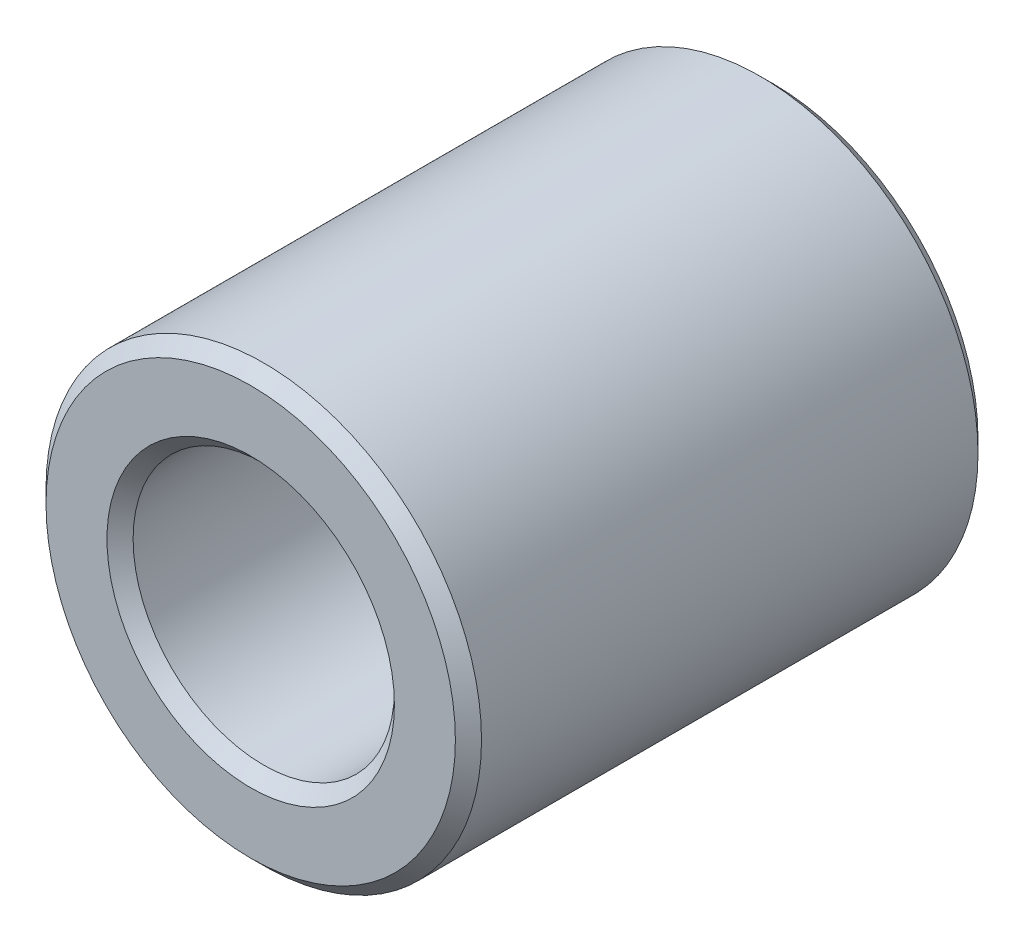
ISO-10303-21;
HEADER;
FILE_DESCRIPTION(('STEP AP214'),'2;1');
FILE_NAME('part.step','',(''),(''),'','','');
FILE_SCHEMA(('AUTOMOTIVE_DESIGN { 1 0 10303 214 1 1 1 1 }'));
ENDSEC;
DATA;
#1=APPLICATION_CONTEXT('core data for automotive mechanical design processes');
#2=APPLICATION_PROTOCOL_DEFINITION('international standard','automotive_design',2000,#1);
#3=PRODUCT_CONTEXT('',#1,'mechanical');
#4=PRODUCT('Part','Part','',(#3));
#5=PRODUCT_RELATED_PRODUCT_CATEGORY('part','',(#4));
#6=PRODUCT_DEFINITION_FORMATION('','',#4);
#7=PRODUCT_DEFINITION_CONTEXT('part definition',#1,'design');
#8=PRODUCT_DEFINITION('design','',#6,#7);
#9=PRODUCT_DEFINITION_SHAPE('','',#8);
#10=(LENGTH_UNIT() NAMED_UNIT(*) SI_UNIT(.MILLI.,.METRE.));
#11=(NAMED_UNIT(*) PLANE_ANGLE_UNIT() SI_UNIT($,.RADIAN.));
#12=(NAMED_UNIT(*) SI_UNIT($,.STERADIAN.) SOLID_ANGLE_UNIT());
#13=UNCERTAINTY_MEASURE_WITH_UNIT(LENGTH_MEASURE(1.E-05),#10,'distance_accuracy_value','');
#14=(GEOMETRIC_REPRESENTATION_CONTEXT(3) GLOBAL_UNCERTAINTY_ASSIGNED_CONTEXT((#13)) GLOBAL_UNIT_ASSIGNED_CONTEXT((#10,
#11,#12)) REPRESENTATION_CONTEXT('',''));
#15=CARTESIAN_POINT('',(0.,0.,0.));
#16=DIRECTION('',(0.,0.,1.));
#17=DIRECTION('',(1.,0.,0.));
#18=AXIS2_PLACEMENT_3D('',#15,#16,#17);
#19=CARTESIAN_POINT('',(0.,0.,60.));
#20=DIRECTION('',(0.,0.,1.));
#21=DIRECTION('',(1.,0.,0.));
#22=AXIS2_PLACEMENT_3D('',#19,#20,#21);
#23=PLANE('',#22);
#24=CARTESIAN_POINT('',(0.,0.,60.));
#25=DIRECTION('',(0.,0.,1.));
#26=DIRECTION('',(1.,0.,0.));
#27=AXIS2_PLACEMENT_3D('',#24,#25,#26);
#28=CIRCLE('',#27,33.0000000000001);
#29=CARTESIAN_POINT('',(33.0000000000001,0.,60.));
#30=VERTEX_POINT('',#29);
#31=EDGE_CURVE('E10',#30,#30,#28,.F.);
#32=ORIENTED_EDGE('',*,*,#31,.T.);
#33=EDGE_LOOP('',(#32));
#34=FACE_BOUND('',#33,.T.);
#35=CARTESIAN_POINT('',(0.,0.,60.));
#36=DIRECTION('',(0.,0.,1.));
#37=DIRECTION('',(1.,0.,0.));
#38=AXIS2_PLACEMENT_3D('',#35,#36,#37);
#39=CIRCLE('',#38,47.);
#40=CARTESIAN_POINT('',(47.,0.,60.));
#41=VERTEX_POINT('',#40);
#42=EDGE_CURVE('E45',#41,#41,#39,.T.);
#43=ORIENTED_EDGE('',*,*,#42,.T.);
#44=EDGE_LOOP('',(#43));
#45=FACE_BOUND('',#44,.T.);
#46=ADVANCED_FACE('F37',(#34,#45),#23,.T.);
#47=CARTESIAN_POINT('',(0.,0.,-60.));
#48=DIRECTION('',(0.,0.,1.));
#49=DIRECTION('',(1.,0.,0.));
#50=AXIS2_PLACEMENT_3D('',#47,#48,#49);
#51=PLANE('',#50);
#52=CARTESIAN_POINT('',(0.,0.,-60.));
#53=DIRECTION('',(0.,0.,1.));
#54=DIRECTION('',(1.,0.,0.));
#55=AXIS2_PLACEMENT_3D('',#52,#53,#54);
#56=CIRCLE('',#55,33.);
#57=CARTESIAN_POINT('',(33.,0.,-60.));
#58=VERTEX_POINT('',#57);
#59=EDGE_CURVE('E69',#58,#58,#56,.T.);
#60=ORIENTED_EDGE('',*,*,#59,.T.);
#61=EDGE_LOOP('',(#60));
#62=FACE_BOUND('',#61,.T.);
#63=CARTESIAN_POINT('',(0.,0.,-60.));
#64=DIRECTION('',(0.,0.,1.));
#65=DIRECTION('',(1.,0.,0.));
#66=AXIS2_PLACEMENT_3D('',#63,#64,#65);
#67=CIRCLE('',#66,47.);
#68=CARTESIAN_POINT('',(47.,0.,-60.));
#69=VERTEX_POINT('',#68);
#70=EDGE_CURVE('E73',#69,#69,#67,.F.);
#71=ORIENTED_EDGE('',*,*,#70,.T.);
#72=EDGE_LOOP('',(#71));
#73=FACE_BOUND('',#72,.T.);
#74=ADVANCED_FACE('F78',(#62,#73),#51,.F.);
#75=CARTESIAN_POINT('',(0.,0.,60.));
#76=DIRECTION('',(0.,0.,-1.));
#77=DIRECTION('',(-1.,0.,0.));
#78=AXIS2_PLACEMENT_3D('',#75,#76,#77);
#79=CYLINDRICAL_SURFACE('',#78,50.);
#80=CARTESIAN_POINT('',(0.,0.,-57.));
#81=DIRECTION('',(0.,0.,1.));
#82=DIRECTION('',(1.,0.,0.));
#83=AXIS2_PLACEMENT_3D('',#80,#81,#82);
#84=CIRCLE('',#83,50.);
#85=CARTESIAN_POINT('',(50.,0.,-57.));
#86=VERTEX_POINT('',#85);
#87=EDGE_CURVE('E52',#86,#86,#84,.T.);
#88=ORIENTED_EDGE('',*,*,#87,.T.);
#89=EDGE_LOOP('',(#88));
#90=FACE_BOUND('',#89,.T.);
#91=CARTESIAN_POINT('',(0.,0.,57.));
#92=DIRECTION('',(0.,0.,1.));
#93=DIRECTION('',(1.,0.,0.));
#94=AXIS2_PLACEMENT_3D('',#91,#92,#93);
#95=CIRCLE('',#94,50.);
#96=CARTESIAN_POINT('',(50.,0.,57.));
#97=VERTEX_POINT('',#96);
#98=EDGE_CURVE('E57',#97,#97,#95,.F.);
#99=ORIENTED_EDGE('',*,*,#98,.T.);
#100=EDGE_LOOP('',(#99));
#101=FACE_BOUND('',#100,.T.);
#102=ADVANCED_FACE('F88',(#90,#101),#79,.T.);
#103=CARTESIAN_POINT('',(0.,0.,60.));
#104=DIRECTION('',(0.,0.,-1.));
#105=DIRECTION('',(-1.,0.,0.));
#106=AXIS2_PLACEMENT_3D('',#103,#104,#105);
#107=CYLINDRICAL_SURFACE('',#106,30.);
#108=CARTESIAN_POINT('',(0.,0.,-57.));
#109=DIRECTION('',(0.,0.,1.));
#110=DIRECTION('',(1.,0.,0.));
#111=AXIS2_PLACEMENT_3D('',#108,#109,#110);
#112=CIRCLE('',#111,30.);
#113=CARTESIAN_POINT('',(30.,0.,-57.));
#114=VERTEX_POINT('',#113);
#115=EDGE_CURVE('E63',#114,#114,#112,.F.);
#116=ORIENTED_EDGE('',*,*,#115,.T.);
#117=EDGE_LOOP('',(#116));
#118=FACE_BOUND('',#117,.T.);
#119=CARTESIAN_POINT('',(0.,0.,56.9999999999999));
#120=DIRECTION('',(0.,0.,1.));
#121=DIRECTION('',(1.,0.,0.));
#122=AXIS2_PLACEMENT_3D('',#119,#120,#121);
#123=CIRCLE('',#122,30.);
#124=CARTESIAN_POINT('',(30.,0.,56.9999999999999));
#125=VERTEX_POINT('',#124);
#126=EDGE_CURVE('E66',#125,#125,#123,.T.);
#127=ORIENTED_EDGE('',*,*,#126,.T.);
#128=EDGE_LOOP('',(#127));
#129=FACE_BOUND('',#128,.T.);
#130=ADVANCED_FACE('F91',(#118,#129),#107,.F.);
#131=CARTESIAN_POINT('',(0.,0.,-60.));
#132=DIRECTION('',(0.,0.,-1.));
#133=DIRECTION('',(-1.,0.,0.));
#134=AXIS2_PLACEMENT_3D('',#131,#132,#133);
#135=CONICAL_SURFACE('',#134,33.,0.785398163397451);
#136=ORIENTED_EDGE('',*,*,#115,.F.);
#137=EDGE_LOOP('',(#136));
#138=FACE_BOUND('',#137,.T.);
#139=ORIENTED_EDGE('',*,*,#59,.F.);
#140=EDGE_LOOP('',(#139));
#141=FACE_BOUND('',#140,.T.);
#142=ADVANCED_FACE('F84',(#138,#141),#135,.F.);
#143=CARTESIAN_POINT('',(0.,0.,-57.));
#144=DIRECTION('',(0.,0.,1.));
#145=DIRECTION('',(1.,0.,0.));
#146=AXIS2_PLACEMENT_3D('',#143,#144,#145);
#147=CONICAL_SURFACE('',#146,50.,0.78539816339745);
#148=ORIENTED_EDGE('',*,*,#70,.F.);
#149=EDGE_LOOP('',(#148));
#150=FACE_BOUND('',#149,.T.);
#151=ORIENTED_EDGE('',*,*,#87,.F.);
#152=EDGE_LOOP('',(#151));
#153=FACE_BOUND('',#152,.T.);
#154=ADVANCED_FACE('F80',(#150,#153),#147,.T.);
#155=CARTESIAN_POINT('',(0.,0.,56.9999999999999));
#156=DIRECTION('',(0.,0.,1.));
#157=DIRECTION('',(1.,0.,0.));
#158=AXIS2_PLACEMENT_3D('',#155,#156,#157);
#159=CONICAL_SURFACE('',#158,30.,0.785398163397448);
#160=ORIENTED_EDGE('',*,*,#31,.F.);
#161=EDGE_LOOP('',(#160));
#162=FACE_BOUND('',#161,.T.);
#163=ORIENTED_EDGE('',*,*,#126,.F.);
#164=EDGE_LOOP('',(#163));
#165=FACE_BOUND('',#164,.T.);
#166=ADVANCED_FACE('F83',(#162,#165),#159,.F.);
#167=CARTESIAN_POINT('',(0.,0.,60.));
#168=DIRECTION('',(0.,0.,-1.));
#169=DIRECTION('',(-1.,0.,0.));
#170=AXIS2_PLACEMENT_3D('',#167,#168,#169);
#171=CONICAL_SURFACE('',#170,47.,0.785398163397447);
#172=ORIENTED_EDGE('',*,*,#98,.F.);
#173=EDGE_LOOP('',(#172));
#174=FACE_BOUND('',#173,.T.);
#175=ORIENTED_EDGE('',*,*,#42,.F.);
#176=EDGE_LOOP('',(#175));
#177=FACE_BOUND('',#176,.T.);
#178=ADVANCED_FACE('F39',(#174,#177),#171,.T.);
#179=CLOSED_SHELL('',(#46,#74,#102,#130,#142,#154,#166,#178));
#180=MANIFOLD_SOLID_BREP('B2',#179);
#181=ADVANCED_BREP_SHAPE_REPRESENTATION('',(#18,#180),#14);
#182=SHAPE_DEFINITION_REPRESENTATION(#9,#181);
ENDSEC;
END-ISO-10303-21;
